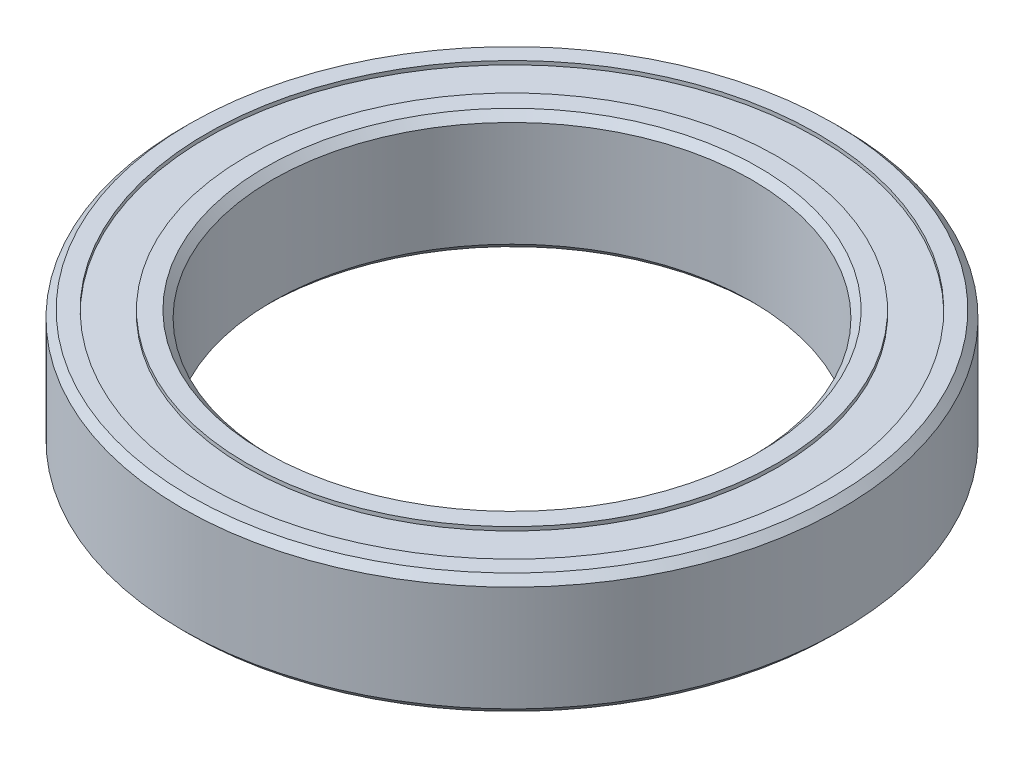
from build123d import *

# Parameters (mm, degrees)
SKETCH1_R      = 17.4625
SKETCH1_R_2    = 12.7
EXTRUDE1_DEPTH = 3.175
SKETCH2_R      = 16.1798
SKETCH2_R_2    = 14.0716
SEAL_DEPTH     = 0.2
CHAMFER1_SIZE  = 0.381


with BuildPart() as part:
    # Sketch1 → Extrude1 (new, symmetric)
    with BuildSketch(Plane(origin=(0, 0, 0), x_dir=(1, 0, 0), z_dir=(0, 1, 0))):
        with Locations(Location((0, 0, 0), (0, 0, 270))):
            Circle(SKETCH1_R)
        with Locations(Location((0, 0, 0), (0, 0, 270))):
            Circle(SKETCH1_R_2, mode=Mode.SUBTRACT)
    extrude(amount=EXTRUDE1_DEPTH, both=True)

    # Sketch2 → Seal (cut)
    with BuildSketch(Plane(origin=(0, 3.175, 0), x_dir=(-1, 0, 0), z_dir=(0, 1, 0))):
        with Locations(Location((0, 0, 0), (0, 0, 90))):
            Circle(SKETCH2_R)
        with Locations(Location((0, 0, 0), (0, 0, 90))):
            Circle(SKETCH2_R_2, mode=Mode.SUBTRACT)
    seal = extrude(amount=-SEAL_DEPTH, mode=Mode.SUBTRACT)

    # Mirror1: Seal across plane
    add(seal.mirror(Plane.ZX), mode=Mode.SUBTRACT)

    # Chamfer1
    chamfer1_edges = [part.edges().sort_by_distance(p)[0] for p in [
        (0, -3.175, -17.4625),
        (0, 3.175, -17.4625),
        (0, -3.175, -12.7),
        (0, 3.175, -12.7),
    ]]
    chamfer(chamfer1_edges, length=CHAMFER1_SIZE)


solid = part.part
